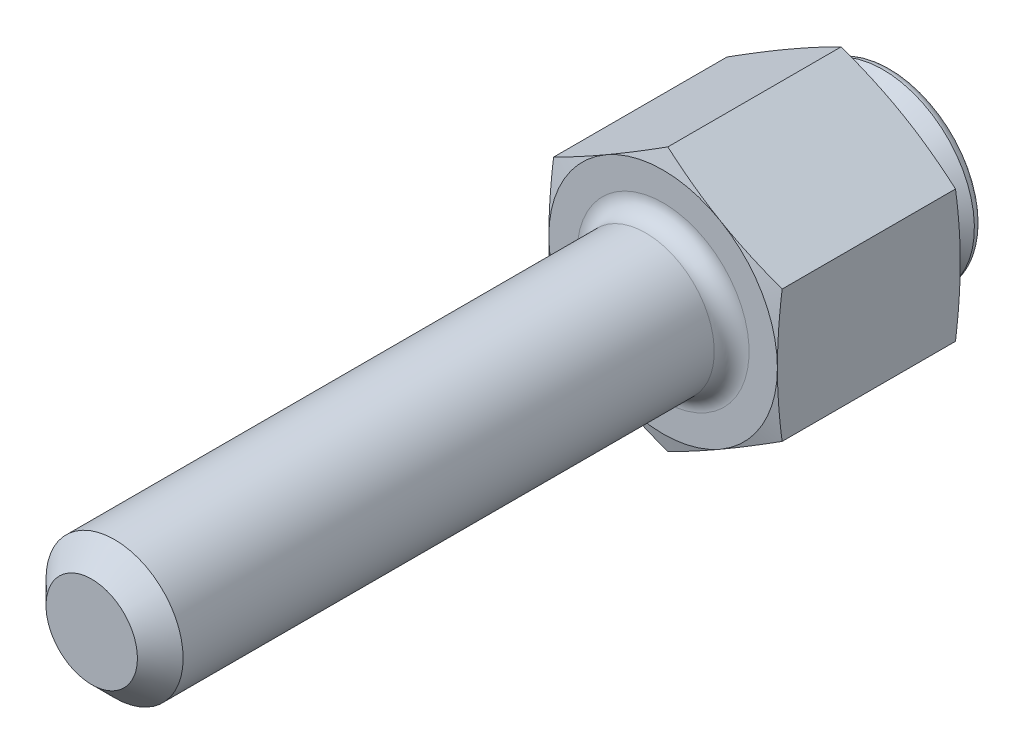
ISO-10303-21;
HEADER;
FILE_DESCRIPTION(('STEP AP214'),'2;1');
FILE_NAME('part.step','',(''),(''),'','','');
FILE_SCHEMA(('AUTOMOTIVE_DESIGN { 1 0 10303 214 1 1 1 1 }'));
ENDSEC;
DATA;
#1=APPLICATION_CONTEXT('core data for automotive mechanical design processes');
#2=APPLICATION_PROTOCOL_DEFINITION('international standard','automotive_design',2000,#1);
#3=PRODUCT_CONTEXT('',#1,'mechanical');
#4=PRODUCT('Part','Part','',(#3));
#5=PRODUCT_RELATED_PRODUCT_CATEGORY('part','',(#4));
#6=PRODUCT_DEFINITION_FORMATION('','',#4);
#7=PRODUCT_DEFINITION_CONTEXT('part definition',#1,'design');
#8=PRODUCT_DEFINITION('design','',#6,#7);
#9=PRODUCT_DEFINITION_SHAPE('','',#8);
#10=(LENGTH_UNIT() NAMED_UNIT(*) SI_UNIT(.MILLI.,.METRE.));
#11=(NAMED_UNIT(*) PLANE_ANGLE_UNIT() SI_UNIT($,.RADIAN.));
#12=(NAMED_UNIT(*) SI_UNIT($,.STERADIAN.) SOLID_ANGLE_UNIT());
#13=UNCERTAINTY_MEASURE_WITH_UNIT(LENGTH_MEASURE(1.E-05),#10,'distance_accuracy_value','');
#14=(GEOMETRIC_REPRESENTATION_CONTEXT(3) GLOBAL_UNCERTAINTY_ASSIGNED_CONTEXT((#13)) GLOBAL_UNIT_ASSIGNED_CONTEXT((#10,
#11,#12)) REPRESENTATION_CONTEXT('',''));
#15=CARTESIAN_POINT('',(0.,0.,0.));
#16=DIRECTION('',(0.,0.,1.));
#17=DIRECTION('',(1.,0.,0.));
#18=AXIS2_PLACEMENT_3D('',#15,#16,#17);
#19=CARTESIAN_POINT('',(0.,0.,4.0013999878));
#20=DIRECTION('',(0.,0.,-1.));
#21=DIRECTION('',(-0.268157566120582,0.963375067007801,0.));
#22=AXIS2_PLACEMENT_3D('',#19,#20,#21);
#23=SPHERICAL_SURFACE('',#22,3.5);
#24=CARTESIAN_POINT('',(0.,0.,2.6349999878));
#25=DIRECTION('',(0.,0.,-1.));
#26=DIRECTION('',(-0.963375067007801,-0.268157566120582,0.));
#27=AXIS2_PLACEMENT_3D('',#24,#25,#26);
#28=CIRCLE('',#27,3.2222586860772);
#29=CARTESIAN_POINT('',(-0.864073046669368,3.1042436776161,2.6349999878));
#30=VERTEX_POINT('',#29);
#31=EDGE_CURVE('E9',#30,#30,#28,.F.);
#32=CARTESIAN_POINT('',(0.,0.,2.25615730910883));
#33=DIRECTION('',(0.,0.,1.));
#34=DIRECTION('',(-0.268157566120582,0.963375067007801,0.));
#35=AXIS2_PLACEMENT_3D('',#32,#33,#34);
#36=CIRCLE('',#35,3.0338305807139);
#37=CARTESIAN_POINT('',(-0.813544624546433,2.92271673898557,2.25615730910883));
#38=VERTEX_POINT('',#37);
#39=EDGE_CURVE('E280',#38,#38,#36,.T.);
#40=CARTESIAN_POINT('',(-0.864073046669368,3.1042436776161,2.6349999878));
#41=CARTESIAN_POINT('',(-0.863611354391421,3.10258501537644,2.63093980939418));
#42=CARTESIAN_POINT('',(-0.863147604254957,3.10091896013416,2.62688288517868));
#43=CARTESIAN_POINT('',(-0.862215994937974,3.09757208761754,2.61877560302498));
#44=CARTESIAN_POINT('',(-0.861748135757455,3.09589127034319,2.61472524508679));
#45=CARTESIAN_POINT('',(-0.860808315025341,3.09251489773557,2.60663115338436));
#46=CARTESIAN_POINT('',(-0.860336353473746,3.0908193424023,2.60258741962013));
#47=CARTESIAN_POINT('',(-0.859388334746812,3.0874135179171,2.59450663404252));
#48=CARTESIAN_POINT('',(-0.858912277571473,3.08570324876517,2.59046958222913));
#49=CARTESIAN_POINT('',(-0.857956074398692,3.08226802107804,2.58240221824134));
#50=CARTESIAN_POINT('',(-0.85747592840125,3.08054306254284,2.57837190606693));
#51=CARTESIAN_POINT('',(-0.856511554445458,3.07707848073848,2.5703180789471));
#52=CARTESIAN_POINT('',(-0.856027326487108,3.07533885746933,2.56629456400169));
#53=CARTESIAN_POINT('',(-0.855054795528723,3.07184497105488,2.55825438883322));
#54=CARTESIAN_POINT('',(-0.854566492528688,3.07009070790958,2.55423772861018));
#55=CARTESIAN_POINT('',(-0.853585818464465,3.0665675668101,2.54621132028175));
#56=CARTESIAN_POINT('',(-0.853093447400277,3.06479868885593,2.54220157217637));
#57=CARTESIAN_POINT('',(-0.852104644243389,3.06124634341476,2.53418904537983));
#58=CARTESIAN_POINT('',(-0.851608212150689,3.05946287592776,2.53018626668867));
#59=CARTESIAN_POINT('',(-0.850611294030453,3.05588137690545,2.52218773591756));
#60=CARTESIAN_POINT('',(-0.850110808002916,3.05408334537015,2.5181919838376));
#61=CARTESIAN_POINT('',(-0.84910578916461,3.05047274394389,2.51020756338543));
#62=CARTESIAN_POINT('',(-0.84860125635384,3.04866017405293,2.50621889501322));
#63=CARTESIAN_POINT('',(-0.847588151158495,3.04502052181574,2.49824869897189));
#64=CARTESIAN_POINT('',(-0.847079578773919,3.0431934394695,2.49426717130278));
#65=CARTESIAN_POINT('',(-0.846058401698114,3.03952478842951,2.48631131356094));
#66=CARTESIAN_POINT('',(-0.845545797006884,3.03768321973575,2.48233698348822));
#67=CARTESIAN_POINT('',(-0.84451656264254,3.03398562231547,2.47439557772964));
#68=CARTESIAN_POINT('',(-0.843999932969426,3.03212959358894,2.47042850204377));
#69=CARTESIAN_POINT('',(-0.842962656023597,3.02840310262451,2.46250166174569));
#70=CARTESIAN_POINT('',(-0.842442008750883,3.0265326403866,2.45854189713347));
#71=CARTESIAN_POINT('',(-0.841396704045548,3.02277730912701,2.450629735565));
#72=CARTESIAN_POINT('',(-0.840872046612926,3.02089244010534,2.44667733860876));
#73=CARTESIAN_POINT('',(-0.839818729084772,3.01710832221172,2.43877996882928));
#74=CARTESIAN_POINT('',(-0.839290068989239,3.01520907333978,2.43483499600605));
#75=CARTESIAN_POINT('',(-0.838228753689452,3.01139622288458,2.42695253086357));
#76=CARTESIAN_POINT('',(-0.837696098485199,3.00948262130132,2.42301503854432));
#77=CARTESIAN_POINT('',(-0.836626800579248,3.00564109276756,2.41514759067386));
#78=CARTESIAN_POINT('',(-0.836090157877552,3.00371316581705,2.41121763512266));
#79=CARTESIAN_POINT('',(-0.835012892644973,2.99984301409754,2.40336531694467));
#80=CARTESIAN_POINT('',(-0.83447227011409,2.99790078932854,2.39944295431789));
#81=CARTESIAN_POINT('',(-0.833387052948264,2.9940020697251,2.39160587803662));
#82=CARTESIAN_POINT('',(-0.832842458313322,2.99204557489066,2.38769116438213));
#83=CARTESIAN_POINT('',(-0.83174930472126,2.98811834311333,2.37986944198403));
#84=CARTESIAN_POINT('',(-0.831200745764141,2.98614760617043,2.37596243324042));
#85=CARTESIAN_POINT('',(-0.830099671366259,2.98219191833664,2.36815617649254));
#86=CARTESIAN_POINT('',(-0.829547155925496,2.98020696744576,2.36425692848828));
#87=CARTESIAN_POINT('',(-0.828438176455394,2.97622288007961,2.3564662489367));
#88=CARTESIAN_POINT('',(-0.827881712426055,2.97422374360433,2.35257481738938));
#89=CARTESIAN_POINT('',(-0.826764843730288,2.97021131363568,2.34479982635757));
#90=CARTESIAN_POINT('',(-0.826204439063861,2.9681980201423,2.34091626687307));
#91=CARTESIAN_POINT('',(-0.825079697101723,2.96415730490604,2.33315707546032));
#92=CARTESIAN_POINT('',(-0.824515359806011,2.96212988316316,2.32928144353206));
#93=CARTESIAN_POINT('',(-0.823382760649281,2.9580609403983,2.32153816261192));
#94=CARTESIAN_POINT('',(-0.822814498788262,2.95601941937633,2.31767051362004));
#95=CARTESIAN_POINT('',(-0.82167405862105,2.95192230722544,2.30994325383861));
#96=CARTESIAN_POINT('',(-0.821101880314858,2.94986671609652,2.30608364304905));
#97=CARTESIAN_POINT('',(-0.819953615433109,2.94574149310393,2.29837251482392));
#98=CARTESIAN_POINT('',(-0.819377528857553,2.94367186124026,2.29452099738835));
#99=CARTESIAN_POINT('',(-0.818221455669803,2.9395185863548,2.28682611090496));
#100=CARTESIAN_POINT('',(-0.817641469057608,2.93743494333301,2.28298274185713));
#101=CARTESIAN_POINT('',(-0.81647760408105,2.93325367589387,2.27530420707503));
#102=CARTESIAN_POINT('',(-0.815893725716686,2.93115605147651,2.27146904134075));
#103=CARTESIAN_POINT('',(-0.814722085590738,2.92694685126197,2.26380696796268));
#104=CARTESIAN_POINT('',(-0.814134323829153,2.92483527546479,2.25998006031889));
#105=CARTESIAN_POINT('',(-0.813544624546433,2.92271673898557,2.25615730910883));
#106=B_SPLINE_CURVE_WITH_KNOTS('',3,(#40,#41,#42,#43,#44,#45,#46,#47,#48,#49,#50,#51,#52,#53,
#54,#55,#56,#57,#58,#59,#60,#61,#62,#63,#64,#65,#66,#67,#68,#69,#70,#71,#72,#73,#74,#75,#76,#77,
#78,#79,#80,#81,#82,#83,#84,#85,#86,#87,#88,#89,#90,#91,#92,#93,#94,#95,#96,#97,#98,#99,#100,
#101,#102,#103,#104,#105),.UNSPECIFIED.,.F.,.F.,(4,2,2,2,2,2,2,2,2,2,2,2,2,2,2,2,2,2,2,2,2,2,2,
2,2,2,2,2,2,2,2,2,4),(0.,0.0132304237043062,0.0264608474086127,0.0396912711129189,
0.0529216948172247,0.0661521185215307,0.0793825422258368,0.0926129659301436,0.10584338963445,
0.119073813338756,0.132304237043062,0.145534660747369,0.158765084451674,0.17199550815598,
0.185225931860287,0.198456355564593,0.211686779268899,0.224917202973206,0.238147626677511,
0.251378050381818,0.264608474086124,0.27783889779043,0.291069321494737,0.304299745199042,
0.317530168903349,0.330760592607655,0.343991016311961,0.357221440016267,0.370451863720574,
0.38368228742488,0.396912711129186,0.410143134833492,0.423373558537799),.UNSPECIFIED.);
#107=EDGE_CURVE('BSEAM14',#30,#38,#106,.T.);
#108=ORIENTED_EDGE('',*,*,#31,.F.);
#109=ORIENTED_EDGE('',*,*,#39,.T.);
#110=ORIENTED_EDGE('',*,*,#107,.T.);
#111=ORIENTED_EDGE('',*,*,#107,.F.);
#112=EDGE_LOOP('',(#108,#110,#109,#111));
#113=FACE_BOUND('',#112,.T.);
#114=ADVANCED_FACE('F14',(#113),#23,.T.);
#115=CARTESIAN_POINT('',(0.,0.,0.));
#116=DIRECTION('',(0.,0.,-1.));
#117=DIRECTION('',(0.268157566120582,-0.963375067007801,0.));
#118=AXIS2_PLACEMENT_3D('',#115,#116,#117);
#119=CYLINDRICAL_SURFACE('',#118,3.);
#120=CARTESIAN_POINT('',(0.,0.,2.12950255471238));
#121=DIRECTION('',(0.,0.,1.));
#122=DIRECTION('',(-0.268157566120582,0.963375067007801,0.));
#123=AXIS2_PLACEMENT_3D('',#120,#121,#122);
#124=CIRCLE('',#123,3.);
#125=CARTESIAN_POINT('',(-0.804472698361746,2.8901252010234,2.12950255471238));
#126=VERTEX_POINT('',#125);
#127=EDGE_CURVE('E278',#126,#126,#124,.F.);
#128=ORIENTED_EDGE('',*,*,#127,.T.);
#129=EDGE_LOOP('',(#128));
#130=FACE_BOUND('',#129,.T.);
#131=CARTESIAN_POINT('',(0.,0.,1.48621024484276));
#132=DIRECTION('',(0.,0.,-1.));
#133=DIRECTION('',(0.268157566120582,-0.963375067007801,0.));
#134=AXIS2_PLACEMENT_3D('',#131,#132,#133);
#135=CIRCLE('',#134,3.);
#136=CARTESIAN_POINT('',(0.804472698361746,-2.8901252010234,1.48621024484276));
#137=VERTEX_POINT('',#136);
#138=EDGE_CURVE('E275',#137,#137,#135,.F.);
#139=ORIENTED_EDGE('',*,*,#138,.T.);
#140=EDGE_LOOP('',(#139));
#141=FACE_BOUND('',#140,.T.);
#142=ADVANCED_FACE('F299',(#130,#141),#119,.T.);
#143=CARTESIAN_POINT('',(0.,0.,1.381));
#144=DIRECTION('',(0.,0.,-1.));
#145=DIRECTION('',(0.268157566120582,-0.963375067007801,0.));
#146=AXIS2_PLACEMENT_3D('',#143,#144,#145);
#147=CONICAL_SURFACE('',#146,3.,0.78539816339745);
#148=CARTESIAN_POINT('',(0.,0.,1.30660512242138));
#149=DIRECTION('',(0.,0.,-1.));
#150=DIRECTION('',(0.268157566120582,-0.963375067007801,0.));
#151=AXIS2_PLACEMENT_3D('',#148,#149,#150);
#152=CIRCLE('',#151,3.07439487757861);
#153=CARTESIAN_POINT('',(0.824422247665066,-2.96179537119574,1.30660512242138));
#154=VERTEX_POINT('',#153);
#155=EDGE_CURVE('E18',#154,#154,#152,.T.);
#156=ORIENTED_EDGE('',*,*,#155,.T.);
#157=EDGE_LOOP('',(#156));
#158=FACE_BOUND('',#157,.T.);
#159=CARTESIAN_POINT('',(0.,0.,0.381));
#160=DIRECTION('',(0.,0.,-1.));
#161=DIRECTION('',(0.268157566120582,-0.963375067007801,0.));
#162=AXIS2_PLACEMENT_3D('',#159,#160,#161);
#163=CIRCLE('',#162,4.);
#164=CARTESIAN_POINT('',(1.07263026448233,-3.8535002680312,0.381));
#165=VERTEX_POINT('',#164);
#166=EDGE_CURVE('E269',#165,#165,#163,.T.);
#167=ORIENTED_EDGE('',*,*,#166,.F.);
#168=EDGE_LOOP('',(#167));
#169=FACE_BOUND('',#168,.T.);
#170=ADVANCED_FACE('F305',(#158,#169),#147,.T.);
#171=CARTESIAN_POINT('',(-1.07263026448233,3.85350026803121,0.));
#172=DIRECTION('',(0.,0.,1.));
#173=DIRECTION('',(-0.268157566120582,0.963375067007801,0.));
#174=AXIS2_PLACEMENT_3D('',#171,#172,#173);
#175=PLANE('',#174);
#176=CARTESIAN_POINT('',(0.,0.,0.));
#177=DIRECTION('',(0.,0.,1.));
#178=DIRECTION('',(-0.268157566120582,0.963375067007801,0.));
#179=AXIS2_PLACEMENT_3D('',#176,#177,#178);
#180=CIRCLE('',#179,3.619);
#181=CARTESIAN_POINT('',(-0.970462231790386,3.48645436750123,0.));
#182=VERTEX_POINT('',#181);
#183=EDGE_CURVE('E272',#182,#182,#180,.F.);
#184=ORIENTED_EDGE('',*,*,#183,.T.);
#185=EDGE_LOOP('',(#184));
#186=FACE_BOUND('',#185,.T.);
#187=ADVANCED_FACE('F347',(#186),#175,.F.);
#188=CARTESIAN_POINT('',(0.,0.,0.381));
#189=DIRECTION('',(0.,0.,1.));
#190=DIRECTION('',(-0.268157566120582,0.963375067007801,0.));
#191=AXIS2_PLACEMENT_3D('',#188,#189,#190);
#192=TOROIDAL_SURFACE('',#191,3.619,0.381);
#193=ORIENTED_EDGE('',*,*,#166,.T.);
#194=EDGE_LOOP('',(#193));
#195=FACE_BOUND('',#194,.T.);
#196=ORIENTED_EDGE('',*,*,#183,.F.);
#197=EDGE_LOOP('',(#196));
#198=FACE_BOUND('',#197,.T.);
#199=ADVANCED_FACE('F350',(#195,#198),#192,.T.);
#200=CARTESIAN_POINT('',(0.,0.,2.12950255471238));
#201=DIRECTION('',(0.,0.,1.));
#202=DIRECTION('',(-0.268157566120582,0.963375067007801,0.));
#203=AXIS2_PLACEMENT_3D('',#200,#201,#202);
#204=TOROIDAL_SURFACE('',#203,3.254,0.254);
#205=ORIENTED_EDGE('',*,*,#39,.F.);
#206=EDGE_LOOP('',(#205));
#207=FACE_BOUND('',#206,.T.);
#208=ORIENTED_EDGE('',*,*,#127,.F.);
#209=EDGE_LOOP('',(#208));
#210=FACE_BOUND('',#209,.T.);
#211=ADVANCED_FACE('F321',(#207,#210),#204,.F.);
#212=CARTESIAN_POINT('',(0.,0.,1.48621024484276));
#213=DIRECTION('',(0.,0.,-1.));
#214=DIRECTION('',(0.268157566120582,-0.963375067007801,0.));
#215=AXIS2_PLACEMENT_3D('',#212,#213,#214);
#216=TOROIDAL_SURFACE('',#215,3.254,0.254);
#217=ORIENTED_EDGE('',*,*,#138,.F.);
#218=EDGE_LOOP('',(#217));
#219=FACE_BOUND('',#218,.T.);
#220=ORIENTED_EDGE('',*,*,#155,.F.);
#221=EDGE_LOOP('',(#220));
#222=FACE_BOUND('',#221,.T.);
#223=ADVANCED_FACE('F16',(#219,#222),#216,.F.);
#224=CARTESIAN_POINT('',(0.,0.,34.9999999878));
#225=DIRECTION('',(0.,0.,1.));
#226=DIRECTION('',(1.,0.,0.));
#227=AXIS2_PLACEMENT_3D('',#224,#225,#226);
#228=PLANE('',#227);
#229=CARTESIAN_POINT('',(0.,0.,34.9999999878));
#230=DIRECTION('',(0.,0.,1.));
#231=DIRECTION('',(1.,0.,0.));
#232=AXIS2_PLACEMENT_3D('',#229,#230,#231);
#233=CIRCLE('',#232,2.);
#234=CARTESIAN_POINT('',(2.,0.,34.9999999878));
#235=VERTEX_POINT('',#234);
#236=EDGE_CURVE('E264',#235,#235,#233,.T.);
#237=ORIENTED_EDGE('',*,*,#236,.T.);
#238=EDGE_LOOP('',(#237));
#239=FACE_BOUND('',#238,.T.);
#240=ADVANCED_FACE('F309',(#239),#228,.T.);
#241=CARTESIAN_POINT('',(0.,0.,34.9999999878));
#242=DIRECTION('',(0.,0.,-1.));
#243=DIRECTION('',(-1.,0.,0.));
#244=AXIS2_PLACEMENT_3D('',#241,#242,#243);
#245=CONICAL_SURFACE('',#244,2.,0.785398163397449);
#246=CARTESIAN_POINT('',(0.,0.,33.9999999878));
#247=DIRECTION('',(0.,0.,1.));
#248=DIRECTION('',(1.,0.,0.));
#249=AXIS2_PLACEMENT_3D('',#246,#247,#248);
#250=CIRCLE('',#249,3.);
#251=CARTESIAN_POINT('',(3.,0.,33.9999999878));
#252=VERTEX_POINT('',#251);
#253=EDGE_CURVE('E23',#252,#252,#250,.F.);
#254=ORIENTED_EDGE('',*,*,#253,.F.);
#255=EDGE_LOOP('',(#254));
#256=FACE_BOUND('',#255,.T.);
#257=ORIENTED_EDGE('',*,*,#236,.F.);
#258=EDGE_LOOP('',(#257));
#259=FACE_BOUND('',#258,.T.);
#260=ADVANCED_FACE('F311',(#256,#259),#245,.T.);
#261=CARTESIAN_POINT('',(0.,0.,34.9999999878));
#262=DIRECTION('',(0.,0.,-1.));
#263=DIRECTION('',(-1.,0.,0.));
#264=AXIS2_PLACEMENT_3D('',#261,#262,#263);
#265=CYLINDRICAL_SURFACE('',#264,3.);
#266=ORIENTED_EDGE('',*,*,#253,.T.);
#267=EDGE_LOOP('',(#266));
#268=FACE_BOUND('',#267,.T.);
#269=CARTESIAN_POINT('',(0.,0.,10.7619999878));
#270=DIRECTION('',(0.,0.,-1.));
#271=DIRECTION('',(-1.,0.,0.));
#272=AXIS2_PLACEMENT_3D('',#269,#270,#271);
#273=CIRCLE('',#272,3.);
#274=CARTESIAN_POINT('',(-3.,0.,10.7619999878));
#275=VERTEX_POINT('',#274);
#276=EDGE_CURVE('E258',#275,#275,#273,.F.);
#277=ORIENTED_EDGE('',*,*,#276,.T.);
#278=EDGE_LOOP('',(#277));
#279=FACE_BOUND('',#278,.T.);
#280=ADVANCED_FACE('F318',(#268,#279),#265,.T.);
#281=CARTESIAN_POINT('',(0.,0.,10.7619999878));
#282=DIRECTION('',(0.,0.,-1.));
#283=DIRECTION('',(-1.,0.,0.));
#284=AXIS2_PLACEMENT_3D('',#281,#282,#283);
#285=TOROIDAL_SURFACE('',#284,3.762,0.762);
#286=CARTESIAN_POINT('',(0.,0.,9.9999999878));
#287=DIRECTION('',(0.,0.,-1.));
#288=DIRECTION('',(-1.,0.,0.));
#289=AXIS2_PLACEMENT_3D('',#286,#287,#288);
#290=CIRCLE('',#289,3.762);
#291=CARTESIAN_POINT('',(-3.762,0.,9.9999999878));
#292=VERTEX_POINT('',#291);
#293=EDGE_CURVE('E261',#292,#292,#290,.T.);
#294=ORIENTED_EDGE('',*,*,#293,.F.);
#295=EDGE_LOOP('',(#294));
#296=FACE_BOUND('',#295,.T.);
#297=ORIENTED_EDGE('',*,*,#276,.F.);
#298=EDGE_LOOP('',(#297));
#299=FACE_BOUND('',#298,.T.);
#300=ADVANCED_FACE('F324',(#296,#299),#285,.F.);
#301=CARTESIAN_POINT('',(-5.,8.66025403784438,9.9999999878));
#302=DIRECTION('',(0.,0.,-1.));
#303=DIRECTION('',(-1.,0.,0.));
#304=AXIS2_PLACEMENT_3D('',#301,#302,#303);
#305=PLANE('',#304);
#306=CARTESIAN_POINT('',(0.,0.,9.9999999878));
#307=DIRECTION('',(0.,0.,-1.));
#308=DIRECTION('',(-1.,0.,0.));
#309=AXIS2_PLACEMENT_3D('',#306,#307,#308);
#310=CIRCLE('',#309,5.);
#311=CARTESIAN_POINT('',(-5.,0.,9.9999999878));
#312=VERTEX_POINT('',#311);
#313=CARTESIAN_POINT('',(-2.5,4.33012701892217,9.9999999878));
#314=VERTEX_POINT('',#313);
#315=EDGE_CURVE('E624',#312,#314,#310,.T.);
#316=ORIENTED_EDGE('',*,*,#315,.F.);
#317=CARTESIAN_POINT('',(0.,0.,9.9999999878));
#318=DIRECTION('',(0.,0.,-1.));
#319=DIRECTION('',(-1.,0.,0.));
#320=AXIS2_PLACEMENT_3D('',#317,#318,#319);
#321=CIRCLE('',#320,5.);
#322=CARTESIAN_POINT('',(-2.5,-4.33012701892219,9.9999999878));
#323=VERTEX_POINT('',#322);
#324=EDGE_CURVE('E235',#323,#312,#321,.T.);
#325=ORIENTED_EDGE('',*,*,#324,.F.);
#326=CARTESIAN_POINT('',(2.5,-4.33012701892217,9.9999999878));
#327=VERTEX_POINT('',#326);
#328=EDGE_CURVE('E249',#327,#323,#321,.T.);
#329=ORIENTED_EDGE('',*,*,#328,.F.);
#330=CARTESIAN_POINT('',(5.,0.,9.9999999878));
#331=VERTEX_POINT('',#330);
#332=EDGE_CURVE('E670',#331,#327,#321,.T.);
#333=ORIENTED_EDGE('',*,*,#332,.F.);
#334=CARTESIAN_POINT('',(2.5,4.33012701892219,9.9999999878));
#335=VERTEX_POINT('',#334);
#336=EDGE_CURVE('E672',#335,#331,#321,.T.);
#337=ORIENTED_EDGE('',*,*,#336,.F.);
#338=EDGE_CURVE('E250',#314,#335,#321,.T.);
#339=ORIENTED_EDGE('',*,*,#338,.F.);
#340=EDGE_LOOP('',(#316,#325,#329,#333,#337,#339));
#341=FACE_BOUND('',#340,.T.);
#342=ORIENTED_EDGE('',*,*,#293,.T.);
#343=EDGE_LOOP('',(#342));
#344=FACE_BOUND('',#343,.T.);
#345=ADVANCED_FACE('F329',(#341,#344),#305,.F.);
#346=CARTESIAN_POINT('',(0.,0.,8.58583630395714));
#347=DIRECTION('',(0.,0.,-1.));
#348=DIRECTION('',(-1.,0.,0.));
#349=AXIS2_PLACEMENT_3D('',#346,#347,#348);
#350=CONICAL_SURFACE('',#349,10.2777307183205,1.30899693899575);
#351=CARTESIAN_POINT('',(5.,-7.71939307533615,8.87535574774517));
#352=CARTESIAN_POINT('',(5.00000000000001,-7.49157817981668,8.92657651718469));
#353=CARTESIAN_POINT('',(5.00000000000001,-7.26362305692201,8.97718453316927));
#354=CARTESIAN_POINT('',(5.00000000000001,-6.80736329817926,9.07684412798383));
#355=CARTESIAN_POINT('',(5.00000000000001,-6.57905864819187,9.1258956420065));
#356=CARTESIAN_POINT('',(5.00000000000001,-6.12183892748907,9.222151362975));
#357=CARTESIAN_POINT('',(5.00000000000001,-5.89292348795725,9.26935382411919));
#358=CARTESIAN_POINT('',(5.00000000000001,-5.43462208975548,9.36141523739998));
#359=CARTESIAN_POINT('',(5.00000000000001,-5.20523613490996,9.40627420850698));
#360=CARTESIAN_POINT('',(5.00000000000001,-4.74777405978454,9.49273650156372));
#361=CARTESIAN_POINT('',(5.00000000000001,-4.51970239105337,9.53436326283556));
#362=CARTESIAN_POINT('',(5.00000000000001,-4.06294165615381,9.61407288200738));
#363=CARTESIAN_POINT('',(5.00000000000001,-3.83425260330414,9.65215581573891));
#364=CARTESIAN_POINT('',(5.00000000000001,-3.37620199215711,9.72393812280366));
#365=CARTESIAN_POINT('',(5.00000000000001,-3.14684049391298,9.75763787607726));
#366=CARTESIAN_POINT('',(5.00000000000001,-2.68738519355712,9.81967591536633));
#367=CARTESIAN_POINT('',(5.,-2.4572913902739,9.84801419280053));
#368=CARTESIAN_POINT('',(5.,-1.99373595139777,9.89854595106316));
#369=CARTESIAN_POINT('',(5.,-1.76026606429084,9.92066484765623));
#370=CARTESIAN_POINT('',(5.00000000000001,-1.29272172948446,9.95724257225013));
#371=CARTESIAN_POINT('',(5.00000000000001,-1.05864729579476,9.9717015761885));
#372=CARTESIAN_POINT('',(5.,-0.590237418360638,9.99211738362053));
#373=CARTESIAN_POINT('',(5.,-0.355902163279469,9.99807842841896));
#374=CARTESIAN_POINT('',(5.,0.112826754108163,10.0011300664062));
#375=CARTESIAN_POINT('',(5.,0.347220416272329,9.99822068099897));
#376=CARTESIAN_POINT('',(5.,0.816634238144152,9.98369271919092));
#377=CARTESIAN_POINT('',(5.,1.05165334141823,9.97204069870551));
#378=CARTESIAN_POINT('',(5.,1.52115001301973,9.94069812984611));
#379=CARTESIAN_POINT('',(5.,1.7556275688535,9.92100739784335));
#380=CARTESIAN_POINT('',(5.,2.22403930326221,9.87460237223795));
#381=CARTESIAN_POINT('',(5.,2.45797299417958,9.84788323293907));
#382=CARTESIAN_POINT('',(5.,2.92508386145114,9.78855862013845));
#383=CARTESIAN_POINT('',(5.,3.15826103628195,9.75595313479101));
#384=CARTESIAN_POINT('',(5.,3.6242567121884,9.68586811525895));
#385=CARTESIAN_POINT('',(5.,3.85707404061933,9.64838085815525));
#386=CARTESIAN_POINT('',(5.,4.32204975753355,9.56950129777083));
#387=CARTESIAN_POINT('',(5.,4.55420812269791,9.5281088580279));
#388=CARTESIAN_POINT('',(5.,5.01796734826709,9.44218275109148));
#389=CARTESIAN_POINT('',(5.,5.24956814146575,9.39764872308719));
#390=CARTESIAN_POINT('',(5.,5.71227051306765,9.30605222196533));
#391=CARTESIAN_POINT('',(5.,5.94337208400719,9.2589897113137));
#392=CARTESIAN_POINT('',(4.99999999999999,6.63618971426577,9.11473521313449));
#393=CARTESIAN_POINT('',(4.99999999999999,7.09727206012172,9.01450411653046));
#394=CARTESIAN_POINT('',(4.99999999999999,8.01819214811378,8.80869227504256));
#395=CARTESIAN_POINT('',(4.99999999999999,8.47802997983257,8.703111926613));
#396=CARTESIAN_POINT('',(4.99999999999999,9.39186405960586,8.48941702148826));
#397=CARTESIAN_POINT('',(4.99999999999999,9.84586964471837,8.38134228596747));
#398=CARTESIAN_POINT('',(4.99999999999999,10.7532680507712,8.16261349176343));
#399=CARTESIAN_POINT('',(4.99999999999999,11.2066608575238,8.05195937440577));
#400=CARTESIAN_POINT('',(4.99999999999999,12.112331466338,7.82893014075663));
#401=CARTESIAN_POINT('',(4.99999999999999,12.5646099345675,7.71655772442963));
#402=CARTESIAN_POINT('',(4.99999999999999,13.4687908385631,7.49037953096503));
#403=CARTESIAN_POINT('',(4.99999999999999,13.9206932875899,7.37657380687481));
#404=CARTESIAN_POINT('',(5.,14.3724678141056,7.26226851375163));
#405=B_SPLINE_CURVE_WITH_KNOTS('',3,(#351,#352,#353,#354,#355,#356,#357,#358,#359,#360,#361,
#362,#363,#364,#365,#366,#367,#368,#369,#370,#371,#372,#373,#374,#375,#376,#377,#378,#379,#380,
#381,#382,#383,#384,#385,#386,#387,#388,#389,#390,#391,#392,#393,#394,#395,#396,#397,#398,#399,
#400,#401,#402,#403,#404),.UNSPECIFIED.,.F.,.F.,(4,2,2,2,2,2,2,2,2,2,2,2,2,2,2,2,2,2,2,2,2,2,2,
2,2,2,4),(0.,0.700508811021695,1.40104675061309,2.10223090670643,2.80340938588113,
3.49890505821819,4.19438584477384,4.88980630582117,5.58522787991,6.28866433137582,
6.99208462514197,7.69515372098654,8.39822112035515,9.10399183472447,9.8097786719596,
10.5160533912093,11.2223295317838,11.9297368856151,12.6371689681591,13.3446824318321,
14.0522064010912,15.4677020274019,16.883092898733,18.283157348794,19.6832536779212,
21.0813391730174,22.4793730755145),.UNSPECIFIED.);
#406=CARTESIAN_POINT('',(5.,-2.88675134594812,9.79274056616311));
#407=VERTEX_POINT('',#406);
#408=EDGE_CURVE('E231',#331,#407,#405,.F.);
#409=ORIENTED_EDGE('',*,*,#408,.F.);
#410=ORIENTED_EDGE('',*,*,#332,.T.);
#411=CARTESIAN_POINT('',(5.0002,-2.88663587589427,9.79270962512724));
#412=CARTESIAN_POINT('',(4.79254599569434,-3.00652497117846,9.824847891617));
#413=CARTESIAN_POINT('',(4.58451548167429,-3.12663144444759,9.85402417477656));
#414=CARTESIAN_POINT('',(4.16771975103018,-3.36726857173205,9.90528421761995));
#415=CARTESIAN_POINT('',(3.95895427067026,-3.48779937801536,9.92736509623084));
#416=CARTESIAN_POINT('',(3.54195440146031,-3.72855436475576,9.96314521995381));
#417=CARTESIAN_POINT('',(3.33372283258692,-3.84877691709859,9.97688713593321));
#418=CARTESIAN_POINT('',(2.91699413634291,-4.08937534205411,9.99531364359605));
#419=CARTESIAN_POINT('',(2.70849706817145,-4.20975118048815,9.9999999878));
#420=CARTESIAN_POINT('',(2.29150293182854,-4.45050285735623,9.9999999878));
#421=CARTESIAN_POINT('',(2.08300586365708,-4.57087869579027,9.99531364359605));
#422=CARTESIAN_POINT('',(1.66627716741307,-4.81147712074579,9.97688713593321));
#423=CARTESIAN_POINT('',(1.45804559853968,-4.93169967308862,9.9631452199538));
#424=CARTESIAN_POINT('',(1.04104572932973,-5.17245465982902,9.92736509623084));
#425=CARTESIAN_POINT('',(0.832280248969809,-5.29298546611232,9.90528421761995));
#426=CARTESIAN_POINT('',(0.415484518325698,-5.53362259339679,9.85402417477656));
#427=CARTESIAN_POINT('',(0.207454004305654,-5.65372906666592,9.824847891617));
#428=CARTESIAN_POINT('',(-0.000200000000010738,-5.7736181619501,9.79270962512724));
#429=B_SPLINE_CURVE_WITH_KNOTS('',3,(#411,#412,#413,#414,#415,#416,#417,#418,#419,#420,#421,
#422,#423,#424,#425,#426,#427,#428),.UNSPECIFIED.,.F.,.F.,(4,2,2,2,2,2,2,2,4),(0.,
0.72580523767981,1.45190481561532,2.17425686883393,2.89646911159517,3.61868135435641,
4.34103340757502,5.06713298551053,5.79293822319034),.UNSPECIFIED.);
#430=EDGE_CURVE('E230',#407,#327,#429,.T.);
#431=ORIENTED_EDGE('',*,*,#430,.F.);
#432=EDGE_LOOP('',(#409,#410,#431));
#433=FACE_BOUND('',#432,.T.);
#434=ADVANCED_FACE('F341',(#433),#350,.T.);
#435=CARTESIAN_POINT('',(-0.000200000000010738,5.7736181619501,9.79270962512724));
#436=CARTESIAN_POINT('',(0.207454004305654,5.65372906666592,9.824847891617));
#437=CARTESIAN_POINT('',(0.415484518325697,5.53362259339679,9.85402417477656));
#438=CARTESIAN_POINT('',(0.832280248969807,5.29298546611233,9.90528421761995));
#439=CARTESIAN_POINT('',(1.04104572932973,5.17245465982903,9.92736509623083));
#440=CARTESIAN_POINT('',(1.45804559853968,4.93169967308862,9.9631452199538));
#441=CARTESIAN_POINT('',(1.66627716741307,4.81147712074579,9.97688713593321));
#442=CARTESIAN_POINT('',(2.08300586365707,4.57087869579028,9.99531364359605));
#443=CARTESIAN_POINT('',(2.29150293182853,4.45050285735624,9.9999999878));
#444=CARTESIAN_POINT('',(2.70849706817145,4.20975118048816,9.9999999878));
#445=CARTESIAN_POINT('',(2.9169941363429,4.08937534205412,9.99531364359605));
#446=CARTESIAN_POINT('',(3.33372283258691,3.8487769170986,9.97688713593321));
#447=CARTESIAN_POINT('',(3.5419544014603,3.72855436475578,9.9631452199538));
#448=CARTESIAN_POINT('',(3.95895427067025,3.48779937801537,9.92736509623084));
#449=CARTESIAN_POINT('',(4.16771975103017,3.36726857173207,9.90528421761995));
#450=CARTESIAN_POINT('',(4.58451548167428,3.12663144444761,9.85402417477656));
#451=CARTESIAN_POINT('',(4.79254599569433,3.00652497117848,9.824847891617));
#452=CARTESIAN_POINT('',(5.0002,2.88663587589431,9.79270962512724));
#453=B_SPLINE_CURVE_WITH_KNOTS('',3,(#435,#436,#437,#438,#439,#440,#441,#442,#443,#444,#445,
#446,#447,#448,#449,#450,#451,#452),.UNSPECIFIED.,.F.,.F.,(4,2,2,2,2,2,2,2,4),(0.,
0.725805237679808,1.45190481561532,2.17425686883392,2.89646911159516,3.6186813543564,
4.341033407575,5.06713298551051,5.79293822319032),.UNSPECIFIED.);
#454=CARTESIAN_POINT('',(5.,2.88675134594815,9.7927405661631));
#455=VERTEX_POINT('',#454);
#456=EDGE_CURVE('E643',#335,#455,#453,.T.);
#457=ORIENTED_EDGE('',*,*,#456,.F.);
#458=ORIENTED_EDGE('',*,*,#336,.T.);
#459=EDGE_CURVE('E217',#455,#331,#405,.F.);
#460=ORIENTED_EDGE('',*,*,#459,.F.);
#461=EDGE_LOOP('',(#457,#458,#460));
#462=FACE_BOUND('',#461,.T.);
#463=ADVANCED_FACE('F418',(#462),#350,.T.);
#464=CARTESIAN_POINT('',(-5.0002,2.88663587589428,9.79270962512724));
#465=CARTESIAN_POINT('',(-4.79254599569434,3.00652497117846,9.824847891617));
#466=CARTESIAN_POINT('',(-4.58451548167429,3.12663144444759,9.85402417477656));
#467=CARTESIAN_POINT('',(-4.16771975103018,3.36726857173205,9.90528421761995));
#468=CARTESIAN_POINT('',(-3.95895427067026,3.48779937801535,9.92736509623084));
#469=CARTESIAN_POINT('',(-3.54195440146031,3.72855436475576,9.9631452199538));
#470=CARTESIAN_POINT('',(-3.33372283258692,3.84877691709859,9.97688713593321));
#471=CARTESIAN_POINT('',(-2.91699413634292,4.08937534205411,9.99531364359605));
#472=CARTESIAN_POINT('',(-2.70849706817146,4.20975118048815,9.9999999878));
#473=CARTESIAN_POINT('',(-2.29150293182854,4.45050285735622,9.9999999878));
#474=CARTESIAN_POINT('',(-2.08300586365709,4.57087869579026,9.99531364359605));
#475=CARTESIAN_POINT('',(-1.66627716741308,4.81147712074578,9.97688713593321));
#476=CARTESIAN_POINT('',(-1.45804559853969,4.93169967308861,9.96314521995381));
#477=CARTESIAN_POINT('',(-1.04104572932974,5.17245465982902,9.92736509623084));
#478=CARTESIAN_POINT('',(-0.83228024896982,5.29298546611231,9.90528421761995));
#479=CARTESIAN_POINT('',(-0.415484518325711,5.53362259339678,9.85402417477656));
#480=CARTESIAN_POINT('',(-0.207454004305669,5.65372906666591,9.824847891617));
#481=CARTESIAN_POINT('',(0.00019999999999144,5.7736181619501,9.79270962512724));
#482=B_SPLINE_CURVE_WITH_KNOTS('',3,(#464,#465,#466,#467,#468,#469,#470,#471,#472,#473,#474,
#475,#476,#477,#478,#479,#480,#481),.UNSPECIFIED.,.F.,.F.,(4,2,2,2,2,2,2,2,4),(0.,
0.725805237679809,1.45190481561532,2.17425686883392,2.89646911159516,3.6186813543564,
4.341033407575,5.06713298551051,5.79293822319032),.UNSPECIFIED.);
#483=CARTESIAN_POINT('',(0.,5.77350269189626,9.7927405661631));
#484=VERTEX_POINT('',#483);
#485=EDGE_CURVE('E626',#314,#484,#482,.T.);
#486=ORIENTED_EDGE('',*,*,#485,.F.);
#487=ORIENTED_EDGE('',*,*,#338,.T.);
#488=EDGE_CURVE('E636',#484,#335,#453,.T.);
#489=ORIENTED_EDGE('',*,*,#488,.F.);
#490=EDGE_LOOP('',(#486,#487,#489));
#491=FACE_BOUND('',#490,.T.);
#492=ADVANCED_FACE('F159',(#491),#350,.T.);
#493=ORIENTED_EDGE('',*,*,#315,.T.);
#494=CARTESIAN_POINT('',(-5.,2.88675134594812,9.7927405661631));
#495=VERTEX_POINT('',#494);
#496=EDGE_CURVE('E629',#495,#314,#482,.T.);
#497=ORIENTED_EDGE('',*,*,#496,.F.);
#498=CARTESIAN_POINT('',(-5.,-7.71939307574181,8.87535574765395));
#499=CARTESIAN_POINT('',(-5.,-7.49157818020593,8.92657651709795));
#500=CARTESIAN_POINT('',(-4.99999999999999,-7.26362305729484,8.97718453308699));
#501=CARTESIAN_POINT('',(-4.99999999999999,-6.80736329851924,9.07684412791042));
#502=CARTESIAN_POINT('',(-4.99999999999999,-6.57905864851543,9.1258956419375));
#503=CARTESIAN_POINT('',(-5.,-6.12183892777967,9.22215136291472));
#504=CARTESIAN_POINT('',(-5.,-5.89292348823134,9.26935382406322));
#505=CARTESIAN_POINT('',(-5.,-5.4346220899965,9.36141523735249));
#506=CARTESIAN_POINT('',(-5.,-5.20523613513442,9.40627420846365));
#507=CARTESIAN_POINT('',(-5.,-4.74777405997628,9.49273650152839));
#508=CARTESIAN_POINT('',(-5.,-4.51970239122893,9.53436326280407));
#509=CARTESIAN_POINT('',(-5.,-4.06294165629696,9.61407288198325));
#510=CARTESIAN_POINT('',(-5.,-3.83425260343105,9.6521558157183));
#511=CARTESIAN_POINT('',(-5.,-3.37620199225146,9.7239381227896));
#512=CARTESIAN_POINT('',(-5.,-3.146840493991,9.75763787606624));
#513=CARTESIAN_POINT('',(-5.,-2.68738519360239,9.81967591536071));
#514=CARTESIAN_POINT('',(-5.,-2.45729139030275,9.84801419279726));
#515=CARTESIAN_POINT('',(-5.,-1.9937359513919,9.89854595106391));
#516=CARTESIAN_POINT('',(-5.,-1.76026606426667,9.92066484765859));
#517=CARTESIAN_POINT('',(-5.,-1.29272172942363,9.95724257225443));
#518=CARTESIAN_POINT('',(-5.,-1.05864729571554,9.97170157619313));
#519=CARTESIAN_POINT('',(-5.,-0.59023741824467,9.99211738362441));
#520=CARTESIAN_POINT('',(-5.,-0.355902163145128,9.99807842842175));
#521=CARTESIAN_POINT('',(-5.,0.112826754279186,10.0011300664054));
#522=CARTESIAN_POINT('',(-5.,0.347220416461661,9.99822068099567));
#523=CARTESIAN_POINT('',(-5.,0.816634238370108,9.98369271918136));
#524=CARTESIAN_POINT('',(-5.00000000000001,1.0516533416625,9.9720406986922));
#525=CARTESIAN_POINT('',(-5.00000000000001,1.52115001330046,9.94069812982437));
#526=CARTESIAN_POINT('',(-5.00000000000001,1.75562756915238,9.92100739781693));
#527=CARTESIAN_POINT('',(-5.00000000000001,2.22403930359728,9.87460237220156));
#528=CARTESIAN_POINT('',(-5.00000000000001,2.45797299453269,9.84788323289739));
#529=CARTESIAN_POINT('',(-5.00000000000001,2.9250838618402,9.78855862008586));
#530=CARTESIAN_POINT('',(-5.,3.15826103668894,9.75595313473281));
#531=CARTESIAN_POINT('',(-5.,3.62425671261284,9.6858681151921));
#532=CARTESIAN_POINT('',(-5.00000000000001,3.85707404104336,9.64838085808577));
#533=CARTESIAN_POINT('',(-5.00000000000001,4.32204975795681,9.56950129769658));
#534=CARTESIAN_POINT('',(-5.00000000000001,4.5542081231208,9.52810885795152));
#535=CARTESIAN_POINT('',(-5.00000000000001,5.0179673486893,9.44218275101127));
#536=CARTESIAN_POINT('',(-5.00000000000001,5.24956814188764,9.39764872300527));
#537=CARTESIAN_POINT('',(-5.00000000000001,5.71227051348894,9.30605222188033));
#538=CARTESIAN_POINT('',(-5.00000000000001,5.94337208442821,9.25898971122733));
#539=CARTESIAN_POINT('',(-5.00000000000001,6.63618971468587,9.11473521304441));
#540=CARTESIAN_POINT('',(-5.00000000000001,7.09727206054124,9.01450411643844));
#541=CARTESIAN_POINT('',(-5.00000000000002,8.01819214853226,8.8086922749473));
#542=CARTESIAN_POINT('',(-5.00000000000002,8.47802998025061,8.70311192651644));
#543=CARTESIAN_POINT('',(-5.00000000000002,9.39186406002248,8.48941702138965));
#544=CARTESIAN_POINT('',(-5.00000000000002,9.84586964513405,8.38134228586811));
#545=CARTESIAN_POINT('',(-5.00000000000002,10.7532680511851,8.16261349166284));
#546=CARTESIAN_POINT('',(-5.00000000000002,11.2066608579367,8.0519593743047));
#547=CARTESIAN_POINT('',(-5.00000000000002,12.1123314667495,7.82893014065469));
#548=CARTESIAN_POINT('',(-5.00000000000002,12.5646099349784,7.71655772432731));
#549=CARTESIAN_POINT('',(-5.00000000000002,13.4687908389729,7.49037953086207));
#550=CARTESIAN_POINT('',(-5.00000000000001,13.9206932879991,7.37657380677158));
#551=CARTESIAN_POINT('',(-5.,14.3724678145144,7.26226851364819));
#552=B_SPLINE_CURVE_WITH_KNOTS('',3,(#498,#499,#500,#501,#502,#503,#504,#505,#506,#507,#508,
#509,#510,#511,#512,#513,#514,#515,#516,#517,#518,#519,#520,#521,#522,#523,#524,#525,#526,#527,
#528,#529,#530,#531,#532,#533,#534,#535,#536,#537,#538,#539,#540,#541,#542,#543,#544,#545,#546,
#547,#548,#549,#550,#551),.UNSPECIFIED.,.F.,.F.,(4,2,2,2,2,2,2,2,2,2,2,2,2,2,2,2,2,2,2,2,2,2,2,
2,2,2,4),(0.,0.700508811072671,1.40104675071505,2.10223090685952,2.80340938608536,
3.49890505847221,4.19438584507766,4.88980630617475,5.58522788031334,6.28866433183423,
6.99208462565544,7.69515372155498,8.39822112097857,9.1039918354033,9.80977867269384,
10.5160533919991,11.2223295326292,11.9297368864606,12.6371689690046,13.3446824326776,
14.0522064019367,15.467702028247,16.8830928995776,18.2831573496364,19.6832536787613,
21.0813391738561,22.4793730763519),.UNSPECIFIED.);
#553=EDGE_CURVE('E642',#312,#495,#552,.T.);
#554=ORIENTED_EDGE('',*,*,#553,.F.);
#555=EDGE_LOOP('',(#493,#497,#554));
#556=FACE_BOUND('',#555,.T.);
#557=ADVANCED_FACE('F429',(#556),#350,.T.);
#558=ORIENTED_EDGE('',*,*,#324,.T.);
#559=CARTESIAN_POINT('',(-5.,-2.88675134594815,9.7927405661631));
#560=VERTEX_POINT('',#559);
#561=EDGE_CURVE('E653',#560,#312,#552,.T.);
#562=ORIENTED_EDGE('',*,*,#561,.F.);
#563=CARTESIAN_POINT('',(0.000199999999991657,-5.7736181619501,9.79270962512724));
#564=CARTESIAN_POINT('',(-0.207454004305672,-5.65372906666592,9.824847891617));
#565=CARTESIAN_POINT('',(-0.415484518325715,-5.53362259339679,9.85402417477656));
#566=CARTESIAN_POINT('',(-0.832280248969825,-5.29298546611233,9.90528421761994));
#567=CARTESIAN_POINT('',(-1.04104572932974,-5.17245465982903,9.92736509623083));
#568=CARTESIAN_POINT('',(-1.4580455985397,-4.93169967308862,9.9631452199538));
#569=CARTESIAN_POINT('',(-1.66627716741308,-4.8114771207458,9.97688713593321));
#570=CARTESIAN_POINT('',(-2.08300586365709,-4.57087869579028,9.99531364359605));
#571=CARTESIAN_POINT('',(-2.29150293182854,-4.45050285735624,9.9999999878));
#572=CARTESIAN_POINT('',(-2.70849706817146,-4.20975118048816,9.9999999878));
#573=CARTESIAN_POINT('',(-2.91699413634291,-4.08937534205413,9.99531364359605));
#574=CARTESIAN_POINT('',(-3.33372283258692,-3.84877691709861,9.97688713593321));
#575=CARTESIAN_POINT('',(-3.54195440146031,-3.72855436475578,9.9631452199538));
#576=CARTESIAN_POINT('',(-3.95895427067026,-3.48779937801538,9.92736509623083));
#577=CARTESIAN_POINT('',(-4.16771975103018,-3.36726857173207,9.90528421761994));
#578=CARTESIAN_POINT('',(-4.58451548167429,-3.12663144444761,9.85402417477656));
#579=CARTESIAN_POINT('',(-4.79254599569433,-3.00652497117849,9.82484789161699));
#580=CARTESIAN_POINT('',(-5.0002,-2.88663587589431,9.79270962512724));
#581=B_SPLINE_CURVE_WITH_KNOTS('',3,(#563,#564,#565,#566,#567,#568,#569,#570,#571,#572,#573,
#574,#575,#576,#577,#578,#579,#580),.UNSPECIFIED.,.F.,.F.,(4,2,2,2,2,2,2,2,4),(0.,
0.725805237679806,1.45190481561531,2.17425686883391,2.89646911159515,3.61868135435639,
4.34103340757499,5.0671329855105,5.7929382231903),.UNSPECIFIED.);
#582=EDGE_CURVE('E208',#323,#560,#581,.T.);
#583=ORIENTED_EDGE('',*,*,#582,.F.);
#584=EDGE_LOOP('',(#558,#562,#583));
#585=FACE_BOUND('',#584,.T.);
#586=ADVANCED_FACE('F430',(#585),#350,.T.);
#587=ORIENTED_EDGE('',*,*,#328,.T.);
#588=CARTESIAN_POINT('',(0.,-5.77350269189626,9.7927405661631));
#589=VERTEX_POINT('',#588);
#590=EDGE_CURVE('E216',#589,#323,#581,.T.);
#591=ORIENTED_EDGE('',*,*,#590,.F.);
#592=EDGE_CURVE('E223',#327,#589,#429,.T.);
#593=ORIENTED_EDGE('',*,*,#592,.F.);
#594=EDGE_LOOP('',(#587,#591,#593));
#595=FACE_BOUND('',#594,.T.);
#596=ADVANCED_FACE('F420',(#595),#350,.T.);
#597=CARTESIAN_POINT('',(5.,-2.88675134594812,9.9999999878));
#598=DIRECTION('',(0.5,-0.866025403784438,0.));
#599=DIRECTION('',(-0.866025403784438,-0.5,0.));
#600=AXIS2_PLACEMENT_3D('',#597,#598,#599);
#601=PLANE('',#600);
#602=DIRECTION('',(0.,0.,-1.));
#603=VECTOR('',#602,1.);
#604=CARTESIAN_POINT('',(0.,-5.77350269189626,9.9999999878));
#605=LINE('',#604,#603);
#606=CARTESIAN_POINT('',(0.,-5.77350269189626,2.2072594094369));
#607=VERTEX_POINT('',#606);
#608=EDGE_CURVE('E236',#589,#607,#605,.T.);
#609=ORIENTED_EDGE('',*,*,#608,.T.);
#610=CARTESIAN_POINT('',(-0.000200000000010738,-5.7736181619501,2.20729035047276));
#611=CARTESIAN_POINT('',(0.207454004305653,-5.65372906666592,2.175152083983));
#612=CARTESIAN_POINT('',(0.415484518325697,-5.53362259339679,2.14597580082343));
#613=CARTESIAN_POINT('',(0.832280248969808,-5.29298546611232,2.09471575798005));
#614=CARTESIAN_POINT('',(1.04104572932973,-5.17245465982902,2.07263487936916));
#615=CARTESIAN_POINT('',(1.45804559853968,-4.93169967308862,2.03685475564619));
#616=CARTESIAN_POINT('',(1.66627716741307,-4.81147712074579,2.02311283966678));
#617=CARTESIAN_POINT('',(2.08300586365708,-4.57087869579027,2.00468633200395));
#618=CARTESIAN_POINT('',(2.29150293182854,-4.45050285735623,1.9999999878));
#619=CARTESIAN_POINT('',(2.70849706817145,-4.20975118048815,1.9999999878));
#620=CARTESIAN_POINT('',(2.91699413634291,-4.08937534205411,2.00468633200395));
#621=CARTESIAN_POINT('',(3.33372283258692,-3.84877691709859,2.02311283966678));
#622=CARTESIAN_POINT('',(3.54195440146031,-3.72855436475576,2.03685475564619));
#623=CARTESIAN_POINT('',(3.95895427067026,-3.48779937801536,2.07263487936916));
#624=CARTESIAN_POINT('',(4.16771975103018,-3.36726857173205,2.09471575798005));
#625=CARTESIAN_POINT('',(4.58451548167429,-3.12663144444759,2.14597580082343));
#626=CARTESIAN_POINT('',(4.79254599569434,-3.00652497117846,2.175152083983));
#627=CARTESIAN_POINT('',(5.0002,-2.88663587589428,2.20729035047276));
#628=B_SPLINE_CURVE_WITH_KNOTS('',3,(#610,#611,#612,#613,#614,#615,#616,#617,#618,#619,#620,
#621,#622,#623,#624,#625,#626,#627),.UNSPECIFIED.,.F.,.F.,(4,2,2,2,2,2,2,2,4),(0.,
0.72580523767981,1.45190481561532,2.17425686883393,2.89646911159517,3.61868135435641,
4.34103340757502,5.06713298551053,5.79293822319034),.UNSPECIFIED.);
#629=CARTESIAN_POINT('',(2.5,-4.33012701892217,1.9999999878));
#630=VERTEX_POINT('',#629);
#631=EDGE_CURVE('E190',#607,#630,#628,.T.);
#632=ORIENTED_EDGE('',*,*,#631,.T.);
#633=CARTESIAN_POINT('',(5.,-2.88675134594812,2.2072594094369));
#634=VERTEX_POINT('',#633);
#635=EDGE_CURVE('E175',#630,#634,#628,.T.);
#636=ORIENTED_EDGE('',*,*,#635,.T.);
#637=DIRECTION('',(0.,0.,-1.));
#638=VECTOR('',#637,1.);
#639=CARTESIAN_POINT('',(5.,-2.88675134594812,9.9999999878));
#640=LINE('',#639,#638);
#641=EDGE_CURVE('E239',#407,#634,#640,.T.);
#642=ORIENTED_EDGE('',*,*,#641,.F.);
#643=ORIENTED_EDGE('',*,*,#430,.T.);
#644=ORIENTED_EDGE('',*,*,#592,.T.);
#645=EDGE_LOOP('',(#609,#632,#636,#642,#643,#644));
#646=FACE_BOUND('',#645,.T.);
#647=ADVANCED_FACE('F204',(#646),#601,.T.);
#648=CARTESIAN_POINT('',(5.,2.88675134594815,9.9999999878));
#649=DIRECTION('',(1.,0.,0.));
#650=DIRECTION('',(0.,-1.,0.));
#651=AXIS2_PLACEMENT_3D('',#648,#649,#650);
#652=PLANE('',#651);
#653=ORIENTED_EDGE('',*,*,#641,.T.);
#654=CARTESIAN_POINT('',(5.,-7.71939307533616,3.12464422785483));
#655=CARTESIAN_POINT('',(5.00000000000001,-7.49157817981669,3.07342345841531));
#656=CARTESIAN_POINT('',(5.00000000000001,-7.26362305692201,3.02281544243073));
#657=CARTESIAN_POINT('',(5.00000000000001,-6.80736329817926,2.92315584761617));
#658=CARTESIAN_POINT('',(5.00000000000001,-6.57905864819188,2.8741043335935));
#659=CARTESIAN_POINT('',(5.00000000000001,-6.12183892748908,2.77784861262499));
#660=CARTESIAN_POINT('',(5.00000000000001,-5.89292348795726,2.73064615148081));
#661=CARTESIAN_POINT('',(5.00000000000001,-5.43462208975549,2.63858473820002));
#662=CARTESIAN_POINT('',(5.00000000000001,-5.20523613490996,2.59372576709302));
#663=CARTESIAN_POINT('',(5.00000000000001,-4.74777405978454,2.50726347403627));
#664=CARTESIAN_POINT('',(5.00000000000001,-4.51970239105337,2.46563671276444));
#665=CARTESIAN_POINT('',(5.00000000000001,-4.06294165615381,2.38592709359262));
#666=CARTESIAN_POINT('',(5.00000000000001,-3.83425260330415,2.34784415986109));
#667=CARTESIAN_POINT('',(5.00000000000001,-3.37620199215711,2.27606185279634));
#668=CARTESIAN_POINT('',(5.00000000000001,-3.14684049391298,2.24236209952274));
#669=CARTESIAN_POINT('',(5.00000000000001,-2.68738519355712,2.18032406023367));
#670=CARTESIAN_POINT('',(5.,-2.4572913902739,2.15198578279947));
#671=CARTESIAN_POINT('',(5.,-1.99373595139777,2.10145402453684));
#672=CARTESIAN_POINT('',(5.,-1.76026606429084,2.07933512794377));
#673=CARTESIAN_POINT('',(5.00000000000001,-1.29272172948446,2.04275740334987));
#674=CARTESIAN_POINT('',(5.00000000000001,-1.05864729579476,2.0282983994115));
#675=CARTESIAN_POINT('',(5.,-0.590237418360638,2.00788259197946));
#676=CARTESIAN_POINT('',(5.,-0.35590216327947,2.00192154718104));
#677=CARTESIAN_POINT('',(5.,0.112826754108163,1.99886990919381));
#678=CARTESIAN_POINT('',(5.,0.347220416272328,2.00177929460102));
#679=CARTESIAN_POINT('',(5.,0.81663423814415,2.01630725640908));
#680=CARTESIAN_POINT('',(5.,1.05165334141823,2.02795927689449));
#681=CARTESIAN_POINT('',(5.,1.52115001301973,2.05930184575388));
#682=CARTESIAN_POINT('',(5.,1.7556275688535,2.07899257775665));
#683=CARTESIAN_POINT('',(5.,2.22403930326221,2.12539760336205));
#684=CARTESIAN_POINT('',(5.,2.45797299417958,2.15211674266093));
#685=CARTESIAN_POINT('',(5.,2.92508386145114,2.21144135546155));
#686=CARTESIAN_POINT('',(5.,3.15826103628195,2.24404684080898));
#687=CARTESIAN_POINT('',(5.,3.6242567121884,2.31413186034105));
#688=CARTESIAN_POINT('',(5.,3.85707404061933,2.35161911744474));
#689=CARTESIAN_POINT('',(5.,4.32204975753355,2.43049867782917));
#690=CARTESIAN_POINT('',(5.,4.55420812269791,2.47189111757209));
#691=CARTESIAN_POINT('',(5.,5.01796734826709,2.55781722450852));
#692=CARTESIAN_POINT('',(5.,5.24956814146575,2.60235125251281));
#693=CARTESIAN_POINT('',(5.,5.71227051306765,2.69394775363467));
#694=CARTESIAN_POINT('',(5.,5.94337208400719,2.74101026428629));
#695=CARTESIAN_POINT('',(4.99999999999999,6.63618971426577,2.88526476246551));
#696=CARTESIAN_POINT('',(4.99999999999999,7.09727206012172,2.98549585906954));
#697=CARTESIAN_POINT('',(4.99999999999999,8.01819214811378,3.19130770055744));
#698=CARTESIAN_POINT('',(4.99999999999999,8.47802997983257,3.29688804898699));
#699=CARTESIAN_POINT('',(4.99999999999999,9.39186405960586,3.51058295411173));
#700=CARTESIAN_POINT('',(4.99999999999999,9.84586964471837,3.61865768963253));
#701=CARTESIAN_POINT('',(4.99999999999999,10.7532680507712,3.83738648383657));
#702=CARTESIAN_POINT('',(4.99999999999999,11.2066608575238,3.94804060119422));
#703=CARTESIAN_POINT('',(4.99999999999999,12.112331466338,4.17106983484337));
#704=CARTESIAN_POINT('',(4.99999999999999,12.5646099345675,4.28344225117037));
#705=CARTESIAN_POINT('',(4.99999999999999,13.4687908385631,4.50962044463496));
#706=CARTESIAN_POINT('',(4.99999999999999,13.9206932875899,4.62342616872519));
#707=CARTESIAN_POINT('',(5.,14.3724678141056,4.73773146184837));
#708=B_SPLINE_CURVE_WITH_KNOTS('',3,(#654,#655,#656,#657,#658,#659,#660,#661,#662,#663,#664,
#665,#666,#667,#668,#669,#670,#671,#672,#673,#674,#675,#676,#677,#678,#679,#680,#681,#682,#683,
#684,#685,#686,#687,#688,#689,#690,#691,#692,#693,#694,#695,#696,#697,#698,#699,#700,#701,#702,
#703,#704,#705,#706,#707),.UNSPECIFIED.,.F.,.F.,(4,2,2,2,2,2,2,2,2,2,2,2,2,2,2,2,2,2,2,2,2,2,2,
2,2,2,4),(0.,0.700508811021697,1.40104675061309,2.10223090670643,2.80340938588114,
3.4989050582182,4.19438584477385,4.88980630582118,5.58522787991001,6.28866433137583,
6.99208462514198,7.69515372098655,8.39822112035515,9.10399183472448,9.80977867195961,
10.5160533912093,11.2223295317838,11.9297368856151,12.6371689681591,13.3446824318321,
14.0522064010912,15.4677020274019,16.883092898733,18.283157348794,19.6832536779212,
21.0813391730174,22.4793730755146),.UNSPECIFIED.);
#709=CARTESIAN_POINT('',(5.,0.,1.9999999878));
#710=VERTEX_POINT('',#709);
#711=EDGE_CURVE('E678',#634,#710,#708,.T.);
#712=ORIENTED_EDGE('',*,*,#711,.T.);
#713=CARTESIAN_POINT('',(5.,2.88675134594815,2.2072594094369));
#714=VERTEX_POINT('',#713);
#715=EDGE_CURVE('E168',#710,#714,#708,.T.);
#716=ORIENTED_EDGE('',*,*,#715,.T.);
#717=DIRECTION('',(0.,0.,-1.));
#718=VECTOR('',#717,1.);
#719=CARTESIAN_POINT('',(5.,2.88675134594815,9.9999999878));
#720=LINE('',#719,#718);
#721=EDGE_CURVE('E242',#455,#714,#720,.T.);
#722=ORIENTED_EDGE('',*,*,#721,.F.);
#723=ORIENTED_EDGE('',*,*,#459,.T.);
#724=ORIENTED_EDGE('',*,*,#408,.T.);
#725=EDGE_LOOP('',(#653,#712,#716,#722,#723,#724));
#726=FACE_BOUND('',#725,.T.);
#727=ADVANCED_FACE('F470',(#726),#652,.T.);
#728=CARTESIAN_POINT('',(0.,5.77350269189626,9.9999999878));
#729=DIRECTION('',(0.5,0.86602540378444,0.));
#730=DIRECTION('',(0.86602540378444,-0.5,0.));
#731=AXIS2_PLACEMENT_3D('',#728,#729,#730);
#732=PLANE('',#731);
#733=ORIENTED_EDGE('',*,*,#721,.T.);
#734=CARTESIAN_POINT('',(5.0002,2.88663587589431,2.20729035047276));
#735=CARTESIAN_POINT('',(4.79254599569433,3.00652497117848,2.175152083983));
#736=CARTESIAN_POINT('',(4.58451548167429,3.1266314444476,2.14597580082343));
#737=CARTESIAN_POINT('',(4.16771975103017,3.36726857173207,2.09471575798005));
#738=CARTESIAN_POINT('',(3.95895427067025,3.48779937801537,2.07263487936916));
#739=CARTESIAN_POINT('',(3.5419544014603,3.72855436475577,2.03685475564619));
#740=CARTESIAN_POINT('',(3.33372283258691,3.8487769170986,2.02311283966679));
#741=CARTESIAN_POINT('',(2.9169941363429,4.08937534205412,2.00468633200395));
#742=CARTESIAN_POINT('',(2.70849706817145,4.20975118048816,1.9999999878));
#743=CARTESIAN_POINT('',(2.29150293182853,4.45050285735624,1.9999999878));
#744=CARTESIAN_POINT('',(2.08300586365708,4.57087869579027,2.00468633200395));
#745=CARTESIAN_POINT('',(1.66627716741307,4.81147712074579,2.02311283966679));
#746=CARTESIAN_POINT('',(1.45804559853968,4.93169967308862,2.03685475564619));
#747=CARTESIAN_POINT('',(1.04104572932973,5.17245465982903,2.07263487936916));
#748=CARTESIAN_POINT('',(0.832280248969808,5.29298546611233,2.09471575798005));
#749=CARTESIAN_POINT('',(0.415484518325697,5.53362259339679,2.14597580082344));
#750=CARTESIAN_POINT('',(0.207454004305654,5.65372906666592,2.175152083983));
#751=CARTESIAN_POINT('',(-0.000200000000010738,5.7736181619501,2.20729035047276));
#752=B_SPLINE_CURVE_WITH_KNOTS('',3,(#734,#735,#736,#737,#738,#739,#740,#741,#742,#743,#744,
#745,#746,#747,#748,#749,#750,#751),.UNSPECIFIED.,.F.,.F.,(4,2,2,2,2,2,2,2,4),(0.,
0.725805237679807,1.45190481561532,2.17425686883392,2.89646911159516,3.6186813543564,
4.34103340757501,5.06713298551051,5.79293822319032),.UNSPECIFIED.);
#753=CARTESIAN_POINT('',(2.5,4.33012701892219,1.9999999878));
#754=VERTEX_POINT('',#753);
#755=EDGE_CURVE('E135',#714,#754,#752,.T.);
#756=ORIENTED_EDGE('',*,*,#755,.T.);
#757=CARTESIAN_POINT('',(0.,5.77350269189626,2.2072594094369));
#758=VERTEX_POINT('',#757);
#759=EDGE_CURVE('E115',#754,#758,#752,.T.);
#760=ORIENTED_EDGE('',*,*,#759,.T.);
#761=DIRECTION('',(0.,0.,-1.));
#762=VECTOR('',#761,1.);
#763=CARTESIAN_POINT('',(0.,5.77350269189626,9.9999999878));
#764=LINE('',#763,#762);
#765=EDGE_CURVE('E134',#484,#758,#764,.T.);
#766=ORIENTED_EDGE('',*,*,#765,.F.);
#767=ORIENTED_EDGE('',*,*,#488,.T.);
#768=ORIENTED_EDGE('',*,*,#456,.T.);
#769=EDGE_LOOP('',(#733,#756,#760,#766,#767,#768));
#770=FACE_BOUND('',#769,.T.);
#771=ADVANCED_FACE('F479',(#770),#732,.T.);
#772=CARTESIAN_POINT('',(-5.,2.88675134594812,9.9999999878));
#773=DIRECTION('',(-0.5,0.866025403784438,0.));
#774=DIRECTION('',(0.866025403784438,0.5,0.));
#775=AXIS2_PLACEMENT_3D('',#772,#773,#774);
#776=PLANE('',#775);
#777=ORIENTED_EDGE('',*,*,#765,.T.);
#778=CARTESIAN_POINT('',(0.00019999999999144,5.7736181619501,2.20729035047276));
#779=CARTESIAN_POINT('',(-0.207454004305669,5.65372906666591,2.175152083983));
#780=CARTESIAN_POINT('',(-0.41548451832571,5.53362259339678,2.14597580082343));
#781=CARTESIAN_POINT('',(-0.832280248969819,5.29298546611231,2.09471575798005));
#782=CARTESIAN_POINT('',(-1.04104572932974,5.17245465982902,2.07263487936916));
#783=CARTESIAN_POINT('',(-1.45804559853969,4.93169967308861,2.03685475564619));
#784=CARTESIAN_POINT('',(-1.66627716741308,4.81147712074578,2.02311283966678));
#785=CARTESIAN_POINT('',(-2.08300586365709,4.57087869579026,2.00468633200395));
#786=CARTESIAN_POINT('',(-2.29150293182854,4.45050285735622,1.9999999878));
#787=CARTESIAN_POINT('',(-2.70849706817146,4.20975118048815,1.9999999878));
#788=CARTESIAN_POINT('',(-2.91699413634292,4.08937534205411,2.00468633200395));
#789=CARTESIAN_POINT('',(-3.33372283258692,3.84877691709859,2.02311283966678));
#790=CARTESIAN_POINT('',(-3.54195440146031,3.72855436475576,2.03685475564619));
#791=CARTESIAN_POINT('',(-3.95895427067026,3.48779937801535,2.07263487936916));
#792=CARTESIAN_POINT('',(-4.16771975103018,3.36726857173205,2.09471575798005));
#793=CARTESIAN_POINT('',(-4.58451548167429,3.12663144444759,2.14597580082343));
#794=CARTESIAN_POINT('',(-4.79254599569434,3.00652497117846,2.175152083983));
#795=CARTESIAN_POINT('',(-5.0002,2.88663587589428,2.20729035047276));
#796=B_SPLINE_CURVE_WITH_KNOTS('',3,(#778,#779,#780,#781,#782,#783,#784,#785,#786,#787,#788,
#789,#790,#791,#792,#793,#794,#795),.UNSPECIFIED.,.F.,.F.,(4,2,2,2,2,2,2,2,4),(0.,
0.725805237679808,1.45190481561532,2.17425686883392,2.89646911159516,3.6186813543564,
4.34103340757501,5.06713298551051,5.79293822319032),.UNSPECIFIED.);
#797=CARTESIAN_POINT('',(-2.5,4.33012701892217,1.9999999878));
#798=VERTEX_POINT('',#797);
#799=EDGE_CURVE('E108',#758,#798,#796,.T.);
#800=ORIENTED_EDGE('',*,*,#799,.T.);
#801=CARTESIAN_POINT('',(-5.,2.88675134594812,2.2072594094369));
#802=VERTEX_POINT('',#801);
#803=EDGE_CURVE('E101',#798,#802,#796,.T.);
#804=ORIENTED_EDGE('',*,*,#803,.T.);
#805=DIRECTION('',(0.,0.,-1.));
#806=VECTOR('',#805,1.);
#807=CARTESIAN_POINT('',(-5.,2.88675134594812,9.9999999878));
#808=LINE('',#807,#806);
#809=EDGE_CURVE('E246',#495,#802,#808,.T.);
#810=ORIENTED_EDGE('',*,*,#809,.F.);
#811=ORIENTED_EDGE('',*,*,#496,.T.);
#812=ORIENTED_EDGE('',*,*,#485,.T.);
#813=EDGE_LOOP('',(#777,#800,#804,#810,#811,#812));
#814=FACE_BOUND('',#813,.T.);
#815=ADVANCED_FACE('F131',(#814),#776,.T.);
#816=CARTESIAN_POINT('',(-5.,-2.88675134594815,9.9999999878));
#817=DIRECTION('',(-1.,0.,0.));
#818=DIRECTION('',(0.,1.,0.));
#819=AXIS2_PLACEMENT_3D('',#816,#817,#818);
#820=PLANE('',#819);
#821=ORIENTED_EDGE('',*,*,#809,.T.);
#822=CARTESIAN_POINT('',(-5.,-7.71939307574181,3.12464422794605));
#823=CARTESIAN_POINT('',(-5.,-7.49157818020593,3.07342345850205));
#824=CARTESIAN_POINT('',(-4.99999999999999,-7.26362305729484,3.02281544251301));
#825=CARTESIAN_POINT('',(-4.99999999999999,-6.80736329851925,2.92315584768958));
#826=CARTESIAN_POINT('',(-4.99999999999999,-6.57905864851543,2.8741043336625));
#827=CARTESIAN_POINT('',(-5.,-6.12183892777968,2.77784861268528));
#828=CARTESIAN_POINT('',(-5.,-5.89292348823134,2.73064615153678));
#829=CARTESIAN_POINT('',(-5.,-5.43462208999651,2.63858473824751));
#830=CARTESIAN_POINT('',(-5.,-5.20523613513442,2.59372576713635));
#831=CARTESIAN_POINT('',(-5.,-4.74777405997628,2.50726347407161));
#832=CARTESIAN_POINT('',(-5.,-4.51970239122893,2.46563671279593));
#833=CARTESIAN_POINT('',(-5.,-4.06294165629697,2.38592709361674));
#834=CARTESIAN_POINT('',(-5.,-3.83425260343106,2.3478441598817));
#835=CARTESIAN_POINT('',(-5.,-3.37620199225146,2.2760618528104));
#836=CARTESIAN_POINT('',(-5.,-3.146840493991,2.24236209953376));
#837=CARTESIAN_POINT('',(-5.,-2.68738519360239,2.18032406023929));
#838=CARTESIAN_POINT('',(-5.,-2.45729139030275,2.15198578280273));
#839=CARTESIAN_POINT('',(-5.,-1.9937359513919,2.10145402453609));
#840=CARTESIAN_POINT('',(-5.,-1.76026606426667,2.07933512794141));
#841=CARTESIAN_POINT('',(-5.,-1.29272172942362,2.04275740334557));
#842=CARTESIAN_POINT('',(-5.,-1.05864729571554,2.02829839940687));
#843=CARTESIAN_POINT('',(-5.,-0.590237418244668,2.00788259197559));
#844=CARTESIAN_POINT('',(-5.,-0.355902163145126,2.00192154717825));
#845=CARTESIAN_POINT('',(-5.,0.112826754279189,1.99886990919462));
#846=CARTESIAN_POINT('',(-5.,0.347220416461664,2.00177929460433));
#847=CARTESIAN_POINT('',(-5.,0.81663423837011,2.01630725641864));
#848=CARTESIAN_POINT('',(-5.00000000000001,1.0516533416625,2.0279592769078));
#849=CARTESIAN_POINT('',(-5.00000000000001,1.52115001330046,2.05930184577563));
#850=CARTESIAN_POINT('',(-5.00000000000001,1.75562756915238,2.07899257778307));
#851=CARTESIAN_POINT('',(-5.00000000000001,2.22403930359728,2.12539760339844));
#852=CARTESIAN_POINT('',(-5.00000000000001,2.45797299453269,2.15211674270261));
#853=CARTESIAN_POINT('',(-5.00000000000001,2.9250838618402,2.21144135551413));
#854=CARTESIAN_POINT('',(-5.,3.15826103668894,2.24404684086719));
#855=CARTESIAN_POINT('',(-5.,3.62425671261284,2.3141318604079));
#856=CARTESIAN_POINT('',(-5.00000000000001,3.85707404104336,2.35161911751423));
#857=CARTESIAN_POINT('',(-5.00000000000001,4.32204975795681,2.43049867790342));
#858=CARTESIAN_POINT('',(-5.00000000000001,4.5542081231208,2.47189111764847));
#859=CARTESIAN_POINT('',(-5.00000000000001,5.0179673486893,2.55781722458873));
#860=CARTESIAN_POINT('',(-5.00000000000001,5.24956814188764,2.60235125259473));
#861=CARTESIAN_POINT('',(-5.00000000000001,5.71227051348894,2.69394775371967));
#862=CARTESIAN_POINT('',(-5.00000000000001,5.9433720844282,2.74101026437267));
#863=CARTESIAN_POINT('',(-5.00000000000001,6.63618971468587,2.88526476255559));
#864=CARTESIAN_POINT('',(-5.00000000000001,7.09727206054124,2.98549585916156));
#865=CARTESIAN_POINT('',(-5.00000000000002,8.01819214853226,3.19130770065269));
#866=CARTESIAN_POINT('',(-5.00000000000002,8.4780299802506,3.29688804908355));
#867=CARTESIAN_POINT('',(-5.00000000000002,9.39186406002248,3.51058295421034));
#868=CARTESIAN_POINT('',(-5.00000000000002,9.84586964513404,3.61865768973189));
#869=CARTESIAN_POINT('',(-5.00000000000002,10.7532680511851,3.83738648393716));
#870=CARTESIAN_POINT('',(-5.00000000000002,11.2066608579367,3.9480406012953));
#871=CARTESIAN_POINT('',(-5.00000000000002,12.1123314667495,4.17106983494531));
#872=CARTESIAN_POINT('',(-5.00000000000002,12.5646099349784,4.28344225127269));
#873=CARTESIAN_POINT('',(-5.00000000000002,13.4687908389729,4.50962044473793));
#874=CARTESIAN_POINT('',(-5.00000000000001,13.9206932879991,4.62342616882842));
#875=CARTESIAN_POINT('',(-5.,14.3724678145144,4.73773146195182));
#876=B_SPLINE_CURVE_WITH_KNOTS('',3,(#822,#823,#824,#825,#826,#827,#828,#829,#830,#831,#832,
#833,#834,#835,#836,#837,#838,#839,#840,#841,#842,#843,#844,#845,#846,#847,#848,#849,#850,#851,
#852,#853,#854,#855,#856,#857,#858,#859,#860,#861,#862,#863,#864,#865,#866,#867,#868,#869,#870,
#871,#872,#873,#874,#875),.UNSPECIFIED.,.F.,.F.,(4,2,2,2,2,2,2,2,2,2,2,2,2,2,2,2,2,2,2,2,2,2,2,
2,2,2,4),(0.,0.700508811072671,1.40104675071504,2.10223090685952,2.80340938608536,
3.49890505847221,4.19438584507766,4.88980630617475,5.58522788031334,6.28866433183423,
6.99208462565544,7.69515372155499,8.39822112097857,9.1039918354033,9.80977867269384,
10.5160533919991,11.2223295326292,11.9297368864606,12.6371689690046,13.3446824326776,
14.0522064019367,15.467702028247,16.8830928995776,18.2831573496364,19.6832536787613,
21.0813391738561,22.4793730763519),.UNSPECIFIED.);
#877=CARTESIAN_POINT('',(-5.,0.,1.9999999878));
#878=VERTEX_POINT('',#877);
#879=EDGE_CURVE('E35',#802,#878,#876,.F.);
#880=ORIENTED_EDGE('',*,*,#879,.T.);
#881=CARTESIAN_POINT('',(-5.,-2.88675134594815,2.2072594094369));
#882=VERTEX_POINT('',#881);
#883=EDGE_CURVE('E191',#878,#882,#876,.F.);
#884=ORIENTED_EDGE('',*,*,#883,.T.);
#885=DIRECTION('',(0.,0.,-1.));
#886=VECTOR('',#885,1.);
#887=CARTESIAN_POINT('',(-5.,-2.88675134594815,9.9999999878));
#888=LINE('',#887,#886);
#889=EDGE_CURVE('E232',#560,#882,#888,.T.);
#890=ORIENTED_EDGE('',*,*,#889,.F.);
#891=ORIENTED_EDGE('',*,*,#561,.T.);
#892=ORIENTED_EDGE('',*,*,#553,.T.);
#893=EDGE_LOOP('',(#821,#880,#884,#890,#891,#892));
#894=FACE_BOUND('',#893,.T.);
#895=ADVANCED_FACE('F202',(#894),#820,.T.);
#896=CARTESIAN_POINT('',(0.,-5.77350269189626,9.9999999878));
#897=DIRECTION('',(-0.5,-0.86602540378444,0.));
#898=DIRECTION('',(-0.86602540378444,0.5,0.));
#899=AXIS2_PLACEMENT_3D('',#896,#897,#898);
#900=PLANE('',#899);
#901=ORIENTED_EDGE('',*,*,#889,.T.);
#902=CARTESIAN_POINT('',(-5.0002,-2.88663587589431,2.20729035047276));
#903=CARTESIAN_POINT('',(-4.79254599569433,-3.00652497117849,2.175152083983));
#904=CARTESIAN_POINT('',(-4.58451548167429,-3.12663144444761,2.14597580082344));
#905=CARTESIAN_POINT('',(-4.16771975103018,-3.36726857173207,2.09471575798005));
#906=CARTESIAN_POINT('',(-3.95895427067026,-3.48779937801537,2.07263487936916));
#907=CARTESIAN_POINT('',(-3.54195440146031,-3.72855436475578,2.0368547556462));
#908=CARTESIAN_POINT('',(-3.33372283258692,-3.84877691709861,2.02311283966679));
#909=CARTESIAN_POINT('',(-2.91699413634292,-4.08937534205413,2.00468633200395));
#910=CARTESIAN_POINT('',(-2.70849706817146,-4.20975118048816,1.9999999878));
#911=CARTESIAN_POINT('',(-2.29150293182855,-4.45050285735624,1.9999999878));
#912=CARTESIAN_POINT('',(-2.08300586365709,-4.57087869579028,2.00468633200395));
#913=CARTESIAN_POINT('',(-1.66627716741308,-4.81147712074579,2.02311283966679));
#914=CARTESIAN_POINT('',(-1.4580455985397,-4.93169967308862,2.0368547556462));
#915=CARTESIAN_POINT('',(-1.04104572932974,-5.17245465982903,2.07263487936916));
#916=CARTESIAN_POINT('',(-0.832280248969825,-5.29298546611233,2.09471575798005));
#917=CARTESIAN_POINT('',(-0.415484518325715,-5.53362259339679,2.14597580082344));
#918=CARTESIAN_POINT('',(-0.207454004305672,-5.65372906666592,2.175152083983));
#919=CARTESIAN_POINT('',(0.000199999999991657,-5.7736181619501,2.20729035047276));
#920=B_SPLINE_CURVE_WITH_KNOTS('',3,(#902,#903,#904,#905,#906,#907,#908,#909,#910,#911,#912,
#913,#914,#915,#916,#917,#918,#919),.UNSPECIFIED.,.F.,.F.,(4,2,2,2,2,2,2,2,4),(0.,
0.725805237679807,1.45190481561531,2.17425686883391,2.89646911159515,3.61868135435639,
4.34103340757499,5.0671329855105,5.79293822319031),.UNSPECIFIED.);
#921=CARTESIAN_POINT('',(-2.5,-4.33012701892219,1.9999999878));
#922=VERTEX_POINT('',#921);
#923=EDGE_CURVE('E189',#882,#922,#920,.T.);
#924=ORIENTED_EDGE('',*,*,#923,.T.);
#925=EDGE_CURVE('E182',#922,#607,#920,.T.);
#926=ORIENTED_EDGE('',*,*,#925,.T.);
#927=ORIENTED_EDGE('',*,*,#608,.F.);
#928=ORIENTED_EDGE('',*,*,#590,.T.);
#929=ORIENTED_EDGE('',*,*,#582,.T.);
#930=EDGE_LOOP('',(#901,#924,#926,#927,#928,#929));
#931=FACE_BOUND('',#930,.T.);
#932=ADVANCED_FACE('F197',(#931),#900,.T.);
#933=CARTESIAN_POINT('',(0.,0.,1.9999999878));
#934=DIRECTION('',(0.,0.,1.));
#935=DIRECTION('',(1.,0.,0.));
#936=AXIS2_PLACEMENT_3D('',#933,#934,#935);
#937=CONICAL_SURFACE('',#936,5.,1.30899693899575);
#938=CARTESIAN_POINT('',(0.,0.,1.9999999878));
#939=DIRECTION('',(0.,0.,-1.));
#940=DIRECTION('',(-1.,0.,0.));
#941=AXIS2_PLACEMENT_3D('',#938,#939,#940);
#942=CIRCLE('',#941,5.);
#943=EDGE_CURVE('E252',#630,#922,#942,.T.);
#944=ORIENTED_EDGE('',*,*,#943,.F.);
#945=ORIENTED_EDGE('',*,*,#631,.F.);
#946=ORIENTED_EDGE('',*,*,#925,.F.);
#947=EDGE_LOOP('',(#944,#945,#946));
#948=FACE_BOUND('',#947,.T.);
#949=ADVANCED_FACE('F201',(#948),#937,.T.);
#950=EDGE_CURVE('E620',#710,#630,#942,.T.);
#951=ORIENTED_EDGE('',*,*,#950,.F.);
#952=ORIENTED_EDGE('',*,*,#711,.F.);
#953=ORIENTED_EDGE('',*,*,#635,.F.);
#954=EDGE_LOOP('',(#951,#952,#953));
#955=FACE_BOUND('',#954,.T.);
#956=ADVANCED_FACE('F519',(#955),#937,.T.);
#957=EDGE_CURVE('E121',#754,#710,#942,.T.);
#958=ORIENTED_EDGE('',*,*,#957,.F.);
#959=ORIENTED_EDGE('',*,*,#755,.F.);
#960=ORIENTED_EDGE('',*,*,#715,.F.);
#961=EDGE_LOOP('',(#958,#959,#960));
#962=FACE_BOUND('',#961,.T.);
#963=ADVANCED_FACE('F156',(#962),#937,.T.);
#964=EDGE_CURVE('E112',#798,#754,#942,.T.);
#965=ORIENTED_EDGE('',*,*,#964,.F.);
#966=ORIENTED_EDGE('',*,*,#799,.F.);
#967=ORIENTED_EDGE('',*,*,#759,.F.);
#968=EDGE_LOOP('',(#965,#966,#967));
#969=FACE_BOUND('',#968,.T.);
#970=ADVANCED_FACE('F113',(#969),#937,.T.);
#971=ORIENTED_EDGE('',*,*,#803,.F.);
#972=CARTESIAN_POINT('',(0.,0.,1.9999999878));
#973=DIRECTION('',(0.,0.,-1.));
#974=DIRECTION('',(-1.,0.,0.));
#975=AXIS2_PLACEMENT_3D('',#972,#973,#974);
#976=CIRCLE('',#975,5.);
#977=EDGE_CURVE('E31',#878,#798,#976,.T.);
#978=ORIENTED_EDGE('',*,*,#977,.F.);
#979=ORIENTED_EDGE('',*,*,#879,.F.);
#980=EDGE_LOOP('',(#971,#978,#979));
#981=FACE_BOUND('',#980,.T.);
#982=ADVANCED_FACE('F103',(#981),#937,.T.);
#983=EDGE_CURVE('E123',#922,#878,#942,.T.);
#984=ORIENTED_EDGE('',*,*,#983,.F.);
#985=ORIENTED_EDGE('',*,*,#923,.F.);
#986=ORIENTED_EDGE('',*,*,#883,.F.);
#987=EDGE_LOOP('',(#984,#985,#986));
#988=FACE_BOUND('',#987,.T.);
#989=ADVANCED_FACE('F521',(#988),#937,.T.);
#990=CARTESIAN_POINT('',(-5.,8.66025403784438,1.9999999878));
#991=DIRECTION('',(0.,0.,-1.));
#992=DIRECTION('',(-1.,0.,0.));
#993=AXIS2_PLACEMENT_3D('',#990,#991,#992);
#994=PLANE('',#993);
#995=CARTESIAN_POINT('',(0.,0.,1.9999999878));
#996=DIRECTION('',(0.,0.,-1.));
#997=DIRECTION('',(-1.,0.,0.));
#998=AXIS2_PLACEMENT_3D('',#995,#996,#997);
#999=CIRCLE('',#998,3.8227);
#1000=CARTESIAN_POINT('',(-3.8227,0.,1.9999999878));
#1001=VERTEX_POINT('',#1000);
#1002=EDGE_CURVE('E255',#1001,#1001,#999,.F.);
#1003=ORIENTED_EDGE('',*,*,#1002,.T.);
#1004=EDGE_LOOP('',(#1003));
#1005=FACE_BOUND('',#1004,.T.);
#1006=ORIENTED_EDGE('',*,*,#983,.T.);
#1007=ORIENTED_EDGE('',*,*,#977,.T.);
#1008=ORIENTED_EDGE('',*,*,#964,.T.);
#1009=ORIENTED_EDGE('',*,*,#957,.T.);
#1010=ORIENTED_EDGE('',*,*,#950,.T.);
#1011=ORIENTED_EDGE('',*,*,#943,.T.);
#1012=EDGE_LOOP('',(#1006,#1007,#1008,#1009,#1010,#1011));
#1013=FACE_BOUND('',#1012,.T.);
#1014=ADVANCED_FACE('F125',(#1005,#1013),#994,.T.);
#1015=CARTESIAN_POINT('',(0.,0.,2.25399998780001));
#1016=DIRECTION('',(0.,0.,-1.));
#1017=DIRECTION('',(-1.,0.,0.));
#1018=AXIS2_PLACEMENT_3D('',#1015,#1016,#1017);
#1019=CONICAL_SURFACE('',#1018,3.5687,0.785398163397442);
#1020=ORIENTED_EDGE('',*,*,#1002,.F.);
#1021=EDGE_LOOP('',(#1020));
#1022=FACE_BOUND('',#1021,.T.);
#1023=CARTESIAN_POINT('',(0.,0.,2.25399998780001));
#1024=DIRECTION('',(0.,0.,-1.));
#1025=DIRECTION('',(-1.,0.,0.));
#1026=AXIS2_PLACEMENT_3D('',#1023,#1024,#1025);
#1027=CIRCLE('',#1026,3.5687);
#1028=CARTESIAN_POINT('',(-3.5687,0.,2.25399998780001));
#1029=VERTEX_POINT('',#1028);
#1030=EDGE_CURVE('E120',#1029,#1029,#1027,.T.);
#1031=ORIENTED_EDGE('',*,*,#1030,.F.);
#1032=EDGE_LOOP('',(#1031));
#1033=FACE_BOUND('',#1032,.T.);
#1034=ADVANCED_FACE('F345',(#1022,#1033),#1019,.F.);
#1035=CARTESIAN_POINT('',(0.,0.,5.3019999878));
#1036=DIRECTION('',(0.,0.,-1.));
#1037=DIRECTION('',(-1.,0.,0.));
#1038=AXIS2_PLACEMENT_3D('',#1035,#1036,#1037);
#1039=CYLINDRICAL_SURFACE('',#1038,3.5687);
#1040=CARTESIAN_POINT('',(0.,0.,2.6349999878));
#1041=DIRECTION('',(0.,0.,-1.));
#1042=DIRECTION('',(-1.,0.,0.));
#1043=AXIS2_PLACEMENT_3D('',#1040,#1041,#1042);
#1044=CIRCLE('',#1043,3.5687);
#1045=CARTESIAN_POINT('',(-3.5687,0.,2.6349999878));
#1046=VERTEX_POINT('',#1045);
#1047=EDGE_CURVE('E128',#1046,#1046,#1044,.F.);
#1048=ORIENTED_EDGE('',*,*,#1047,.T.);
#1049=EDGE_LOOP('',(#1048));
#1050=FACE_BOUND('',#1049,.T.);
#1051=ORIENTED_EDGE('',*,*,#1030,.T.);
#1052=EDGE_LOOP('',(#1051));
#1053=FACE_BOUND('',#1052,.T.);
#1054=ADVANCED_FACE('F157',(#1050,#1053),#1039,.F.);
#1055=CARTESIAN_POINT('',(0.,0.,2.6349999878));
#1056=DIRECTION('',(0.,0.,-1.));
#1057=DIRECTION('',(-1.,0.,0.));
#1058=AXIS2_PLACEMENT_3D('',#1055,#1056,#1057);
#1059=PLANE('',#1058);
#1060=ORIENTED_EDGE('',*,*,#1047,.F.);
#1061=EDGE_LOOP('',(#1060));
#1062=FACE_BOUND('',#1061,.T.);
#1063=ORIENTED_EDGE('',*,*,#31,.T.);
#1064=EDGE_LOOP('',(#1063));
#1065=FACE_BOUND('',#1064,.T.);
#1066=ADVANCED_FACE('F292',(#1062,#1065),#1059,.T.);
#1067=CLOSED_SHELL('',(#114,#142,#170,#187,#199,#211,#223,#240,#260,#280,#300,#345,#434,#463,
#492,#557,#586,#596,#647,#727,#771,#815,#895,#932,#949,#956,#963,#970,#982,#989,#1014,#1034,
#1054,#1066));
#1068=MANIFOLD_SOLID_BREP('B1',#1067);
#1069=ADVANCED_BREP_SHAPE_REPRESENTATION('',(#18,#1068),#14);
#1070=SHAPE_DEFINITION_REPRESENTATION(#9,#1069);
ENDSEC;
END-ISO-10303-21;
